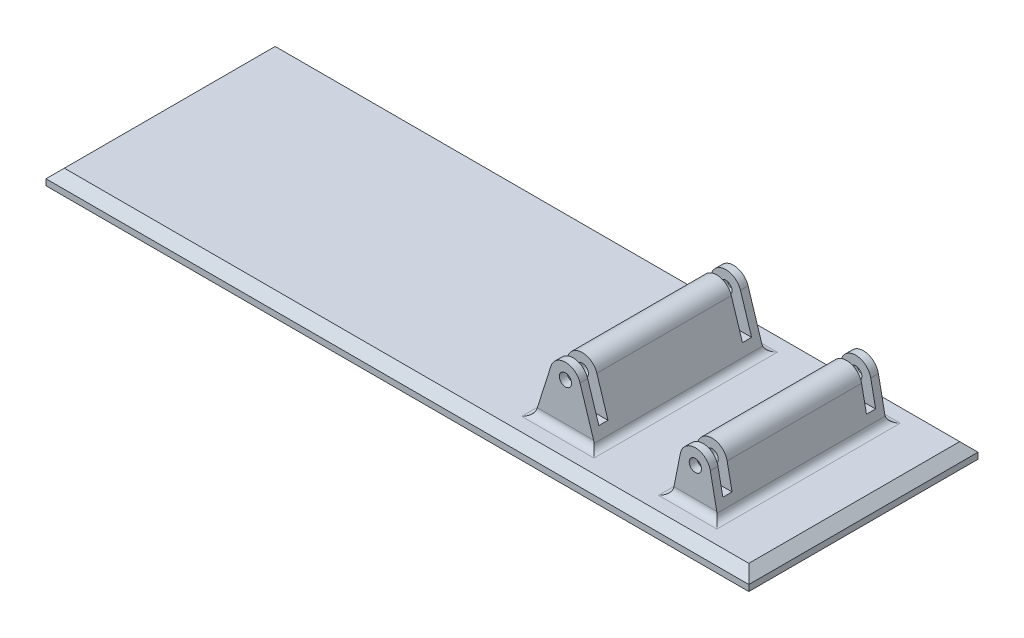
ISO-10303-21;
HEADER;
FILE_DESCRIPTION(('STEP AP214'),'2;1');
FILE_NAME('part.step','',(''),(''),'','','');
FILE_SCHEMA(('AUTOMOTIVE_DESIGN { 1 0 10303 214 1 1 1 1 }'));
ENDSEC;
DATA;
#1=APPLICATION_CONTEXT('core data for automotive mechanical design processes');
#2=APPLICATION_PROTOCOL_DEFINITION('international standard','automotive_design',2000,#1);
#3=PRODUCT_CONTEXT('',#1,'mechanical');
#4=PRODUCT('Part','Part','',(#3));
#5=PRODUCT_RELATED_PRODUCT_CATEGORY('part','',(#4));
#6=PRODUCT_DEFINITION_FORMATION('','',#4);
#7=PRODUCT_DEFINITION_CONTEXT('part definition',#1,'design');
#8=PRODUCT_DEFINITION('design','',#6,#7);
#9=PRODUCT_DEFINITION_SHAPE('','',#8);
#10=(LENGTH_UNIT() NAMED_UNIT(*) SI_UNIT(.MILLI.,.METRE.));
#11=(NAMED_UNIT(*) PLANE_ANGLE_UNIT() SI_UNIT($,.RADIAN.));
#12=(NAMED_UNIT(*) SI_UNIT($,.STERADIAN.) SOLID_ANGLE_UNIT());
#13=UNCERTAINTY_MEASURE_WITH_UNIT(LENGTH_MEASURE(1.E-05),#10,'distance_accuracy_value','');
#14=(GEOMETRIC_REPRESENTATION_CONTEXT(3) GLOBAL_UNCERTAINTY_ASSIGNED_CONTEXT((#13)) GLOBAL_UNIT_ASSIGNED_CONTEXT((#10,
#11,#12)) REPRESENTATION_CONTEXT('',''));
#15=CARTESIAN_POINT('',(0.,0.,0.));
#16=DIRECTION('',(0.,0.,1.));
#17=DIRECTION('',(1.,0.,0.));
#18=AXIS2_PLACEMENT_3D('',#15,#16,#17);
#19=CARTESIAN_POINT('',(114.3,38.1,-69.85));
#20=DIRECTION('',(0.,0.,1.));
#21=DIRECTION('',(1.,0.,0.));
#22=AXIS2_PLACEMENT_3D('',#19,#20,#21);
#23=CYLINDRICAL_SURFACE('',#22,12.7);
#24=CARTESIAN_POINT('',(114.3,38.1,-55.88));
#25=DIRECTION('',(0.,0.,-1.));
#26=DIRECTION('',(0.,1.,0.));
#27=AXIS2_PLACEMENT_3D('',#24,#25,#26);
#28=CIRCLE('',#27,12.7);
#29=CARTESIAN_POINT('',(126.40632857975,41.9375523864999,-55.88));
#30=VERTEX_POINT('',#29);
#31=CARTESIAN_POINT('',(102.19367142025,41.9375523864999,-55.88));
#32=VERTEX_POINT('',#31);
#33=EDGE_CURVE('E328',#30,#32,#28,.F.);
#34=ORIENTED_EDGE('',*,*,#33,.T.);
#35=DIRECTION('',(0.,0.,1.));
#36=VECTOR('',#35,1.);
#37=CARTESIAN_POINT('',(102.19367142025,41.9375523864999,-69.85));
#38=LINE('',#37,#36);
#39=CARTESIAN_POINT('',(102.19367142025,41.9375523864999,55.88));
#40=VERTEX_POINT('',#39);
#41=EDGE_CURVE('E424',#32,#40,#38,.T.);
#42=ORIENTED_EDGE('',*,*,#41,.T.);
#43=CARTESIAN_POINT('',(114.3,38.1,55.88));
#44=DIRECTION('',(0.,0.,-1.));
#45=DIRECTION('',(0.,1.,0.));
#46=AXIS2_PLACEMENT_3D('',#43,#44,#45);
#47=CIRCLE('',#46,12.7);
#48=CARTESIAN_POINT('',(126.40632857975,41.9375523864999,55.88));
#49=VERTEX_POINT('',#48);
#50=EDGE_CURVE('E357',#49,#40,#47,.F.);
#51=ORIENTED_EDGE('',*,*,#50,.F.);
#52=DIRECTION('',(0.,0.,1.));
#53=VECTOR('',#52,1.);
#54=CARTESIAN_POINT('',(126.40632857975,41.9375523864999,-69.85));
#55=LINE('',#54,#53);
#56=EDGE_CURVE('E429',#30,#49,#55,.T.);
#57=ORIENTED_EDGE('',*,*,#56,.F.);
#58=EDGE_LOOP('',(#34,#42,#51,#57));
#59=FACE_BOUND('',#58,.T.);
#60=ADVANCED_FACE('F37',(#59),#23,.T.);
#61=CARTESIAN_POINT('',(114.3,38.1,-63.5));
#62=DIRECTION('',(0.,0.,1.));
#63=DIRECTION('',(1.,0.,0.));
#64=AXIS2_PLACEMENT_3D('',#61,#62,#63);
#65=CIRCLE('',#64,12.7);
#66=CARTESIAN_POINT('',(102.19367142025,41.9375523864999,-63.5));
#67=VERTEX_POINT('',#66);
#68=CARTESIAN_POINT('',(126.40632857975,41.9375523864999,-63.5));
#69=VERTEX_POINT('',#68);
#70=EDGE_CURVE('E54',#67,#69,#65,.F.);
#71=ORIENTED_EDGE('',*,*,#70,.T.);
#72=CARTESIAN_POINT('',(126.40632857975,41.9375523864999,-69.85));
#73=VERTEX_POINT('',#72);
#74=EDGE_CURVE('E426',#73,#69,#55,.T.);
#75=ORIENTED_EDGE('',*,*,#74,.F.);
#76=CARTESIAN_POINT('',(114.3,38.1,-69.85));
#77=DIRECTION('',(0.,0.,1.));
#78=DIRECTION('',(1.,0.,0.));
#79=AXIS2_PLACEMENT_3D('',#76,#77,#78);
#80=CIRCLE('',#79,12.7);
#81=CARTESIAN_POINT('',(102.19367142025,41.9375523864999,-69.85));
#82=VERTEX_POINT('',#81);
#83=EDGE_CURVE('E413',#73,#82,#80,.T.);
#84=ORIENTED_EDGE('',*,*,#83,.T.);
#85=EDGE_CURVE('E420',#82,#67,#38,.T.);
#86=ORIENTED_EDGE('',*,*,#85,.T.);
#87=EDGE_LOOP('',(#71,#75,#84,#86));
#88=FACE_BOUND('',#87,.T.);
#89=ADVANCED_FACE('F647',(#88),#23,.T.);
#90=CARTESIAN_POINT('',(222.25,30.48,-69.85));
#91=DIRECTION('',(0.,0.,1.));
#92=DIRECTION('',(1.,0.,0.));
#93=AXIS2_PLACEMENT_3D('',#90,#91,#92);
#94=CYLINDRICAL_SURFACE('',#93,12.7);
#95=DIRECTION('',(0.,0.,1.));
#96=VECTOR('',#95,1.);
#97=CARTESIAN_POINT('',(234.703193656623,32.9715793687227,-69.85));
#98=LINE('',#97,#96);
#99=CARTESIAN_POINT('',(234.703193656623,32.9715793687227,-55.88));
#100=VERTEX_POINT('',#99);
#101=CARTESIAN_POINT('',(234.703193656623,32.9715793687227,55.88));
#102=VERTEX_POINT('',#101);
#103=EDGE_CURVE('E401',#100,#102,#98,.T.);
#104=ORIENTED_EDGE('',*,*,#103,.F.);
#105=CARTESIAN_POINT('',(222.25,30.48,-55.88));
#106=DIRECTION('',(0.,0.,-1.));
#107=DIRECTION('',(0.,1.,0.));
#108=AXIS2_PLACEMENT_3D('',#105,#106,#107);
#109=CIRCLE('',#108,12.7);
#110=CARTESIAN_POINT('',(209.796806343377,32.9715793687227,-55.88));
#111=VERTEX_POINT('',#110);
#112=EDGE_CURVE('E320',#100,#111,#109,.F.);
#113=ORIENTED_EDGE('',*,*,#112,.T.);
#114=DIRECTION('',(0.,0.,1.));
#115=VECTOR('',#114,1.);
#116=CARTESIAN_POINT('',(209.796806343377,32.9715793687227,-69.85));
#117=LINE('',#116,#115);
#118=CARTESIAN_POINT('',(209.796806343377,32.9715793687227,55.88));
#119=VERTEX_POINT('',#118);
#120=EDGE_CURVE('E398',#111,#119,#117,.T.);
#121=ORIENTED_EDGE('',*,*,#120,.T.);
#122=CARTESIAN_POINT('',(222.25,30.48,55.88));
#123=DIRECTION('',(0.,0.,-1.));
#124=DIRECTION('',(0.,1.,0.));
#125=AXIS2_PLACEMENT_3D('',#122,#123,#124);
#126=CIRCLE('',#125,12.7);
#127=EDGE_CURVE('E557',#102,#119,#126,.F.);
#128=ORIENTED_EDGE('',*,*,#127,.F.);
#129=EDGE_LOOP('',(#104,#113,#121,#128));
#130=FACE_BOUND('',#129,.T.);
#131=ADVANCED_FACE('F644',(#130),#94,.T.);
#132=CARTESIAN_POINT('',(209.796806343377,32.9715793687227,-69.85));
#133=VERTEX_POINT('',#132);
#134=CARTESIAN_POINT('',(209.796806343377,32.9715793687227,-63.5));
#135=VERTEX_POINT('',#134);
#136=EDGE_CURVE('E394',#133,#135,#117,.T.);
#137=ORIENTED_EDGE('',*,*,#136,.T.);
#138=CARTESIAN_POINT('',(222.25,30.48,-63.5));
#139=DIRECTION('',(0.,0.,1.));
#140=DIRECTION('',(1.,0.,0.));
#141=AXIS2_PLACEMENT_3D('',#138,#139,#140);
#142=CIRCLE('',#141,12.7);
#143=CARTESIAN_POINT('',(234.703193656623,32.9715793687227,-63.5));
#144=VERTEX_POINT('',#143);
#145=EDGE_CURVE('E62',#135,#144,#142,.F.);
#146=ORIENTED_EDGE('',*,*,#145,.T.);
#147=CARTESIAN_POINT('',(234.703193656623,32.9715793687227,-69.85));
#148=VERTEX_POINT('',#147);
#149=EDGE_CURVE('E307',#148,#144,#98,.T.);
#150=ORIENTED_EDGE('',*,*,#149,.F.);
#151=CARTESIAN_POINT('',(222.25,30.48,-69.85));
#152=DIRECTION('',(0.,0.,1.));
#153=DIRECTION('',(1.,0.,0.));
#154=AXIS2_PLACEMENT_3D('',#151,#152,#153);
#155=CIRCLE('',#154,12.7);
#156=EDGE_CURVE('E387',#148,#133,#155,.T.);
#157=ORIENTED_EDGE('',*,*,#156,.T.);
#158=EDGE_LOOP('',(#137,#146,#150,#157));
#159=FACE_BOUND('',#158,.T.);
#160=ADVANCED_FACE('F646',(#159),#94,.T.);
#161=CARTESIAN_POINT('',(171.433779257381,-100.110570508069,-69.85));
#162=DIRECTION('',(-0.953254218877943,-0.302169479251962,0.));
#163=DIRECTION('',(0.302169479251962,-0.953254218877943,0.));
#164=AXIS2_PLACEMENT_3D('',#161,#162,#163);
#165=PLANE('',#164);
#166=DIRECTION('',(0.302169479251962,-0.953254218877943,0.));
#167=VECTOR('',#166,1.);
#168=CARTESIAN_POINT('',(171.433779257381,-100.110570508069,-55.88));
#169=LINE('',#168,#167);
#170=CARTESIAN_POINT('',(135.674261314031,12.7,-55.88));
#171=VERTEX_POINT('',#170);
#172=EDGE_CURVE('E330',#30,#171,#169,.T.);
#173=ORIENTED_EDGE('',*,*,#172,.F.);
#174=ORIENTED_EDGE('',*,*,#56,.T.);
#175=DIRECTION('',(0.302169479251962,-0.953254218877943,0.));
#176=VECTOR('',#175,1.);
#177=CARTESIAN_POINT('',(171.433779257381,-100.110570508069,55.88));
#178=LINE('',#177,#176);
#179=CARTESIAN_POINT('',(135.674261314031,12.7,55.88));
#180=VERTEX_POINT('',#179);
#181=EDGE_CURVE('E362',#49,#180,#178,.T.);
#182=ORIENTED_EDGE('',*,*,#181,.T.);
#183=DIRECTION('',(0.,0.,1.));
#184=VECTOR('',#183,1.);
#185=CARTESIAN_POINT('',(135.674261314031,12.7,-69.85));
#186=LINE('',#185,#184);
#187=CARTESIAN_POINT('',(135.674261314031,12.7,63.5));
#188=VERTEX_POINT('',#187);
#189=EDGE_CURVE('E370',#180,#188,#186,.T.);
#190=ORIENTED_EDGE('',*,*,#189,.T.);
#191=DIRECTION('',(-0.302169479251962,0.953254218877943,0.));
#192=VECTOR('',#191,1.);
#193=CARTESIAN_POINT('',(171.433779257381,-100.110570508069,63.5));
#194=LINE('',#193,#192);
#195=CARTESIAN_POINT('',(126.40632857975,41.9375523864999,63.5));
#196=VERTEX_POINT('',#195);
#197=EDGE_CURVE('E349',#188,#196,#194,.T.);
#198=ORIENTED_EDGE('',*,*,#197,.T.);
#199=CARTESIAN_POINT('',(126.40632857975,41.9375523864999,69.85));
#200=VERTEX_POINT('',#199);
#201=EDGE_CURVE('E419',#196,#200,#55,.T.);
#202=ORIENTED_EDGE('',*,*,#201,.T.);
#203=DIRECTION('',(0.302169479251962,-0.953254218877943,0.));
#204=VECTOR('',#203,1.);
#205=CARTESIAN_POINT('',(171.433779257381,-100.110570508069,69.85));
#206=LINE('',#205,#204);
#207=CARTESIAN_POINT('',(137.687130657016,6.34999999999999,69.85));
#208=VERTEX_POINT('',#207);
#209=EDGE_CURVE('E397',#200,#208,#206,.T.);
#210=ORIENTED_EDGE('',*,*,#209,.T.);
#211=CARTESIAN_POINT('',(137.687130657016,6.34999999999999,76.2));
#212=DIRECTION('',(-0.953254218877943,-0.302169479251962,0.));
#213=DIRECTION('',(-0.302169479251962,0.953254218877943,0.));
#214=AXIS2_PLACEMENT_3D('',#211,#212,#213);
#215=ELLIPSE('',#214,6.66139197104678,6.35);
#216=CARTESIAN_POINT('',(138.295358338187,4.43122380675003,70.146835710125));
#217=VERTEX_POINT('',#216);
#218=EDGE_CURVE('E530',#208,#217,#215,.T.);
#219=ORIENTED_EDGE('',*,*,#218,.T.);
#220=DIRECTION('',(0.,0.,1.));
#221=VECTOR('',#220,1.);
#222=CARTESIAN_POINT('',(138.295358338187,4.43122380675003,-69.85));
#223=LINE('',#222,#221);
#224=CARTESIAN_POINT('',(138.295358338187,4.43122380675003,-70.1468357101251));
#225=VERTEX_POINT('',#224);
#226=EDGE_CURVE('E509',#217,#225,#223,.F.);
#227=ORIENTED_EDGE('',*,*,#226,.T.);
#228=CARTESIAN_POINT('',(137.687130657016,6.35,-76.2));
#229=DIRECTION('',(-0.953254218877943,-0.302169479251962,0.));
#230=DIRECTION('',(0.302169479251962,-0.953254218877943,0.));
#231=AXIS2_PLACEMENT_3D('',#228,#229,#230);
#232=ELLIPSE('',#231,6.66139197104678,6.35);
#233=CARTESIAN_POINT('',(137.687130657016,6.34999999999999,-69.85));
#234=VERTEX_POINT('',#233);
#235=EDGE_CURVE('E525',#225,#234,#232,.T.);
#236=ORIENTED_EDGE('',*,*,#235,.T.);
#237=DIRECTION('',(0.302169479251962,-0.953254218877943,0.));
#238=VECTOR('',#237,1.);
#239=CARTESIAN_POINT('',(171.433779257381,-100.110570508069,-69.85));
#240=LINE('',#239,#238);
#241=EDGE_CURVE('E410',#73,#234,#240,.T.);
#242=ORIENTED_EDGE('',*,*,#241,.F.);
#243=ORIENTED_EDGE('',*,*,#74,.T.);
#244=DIRECTION('',(-0.302169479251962,0.953254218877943,0.));
#245=VECTOR('',#244,1.);
#246=CARTESIAN_POINT('',(171.433779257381,-100.110570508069,-63.5));
#247=LINE('',#246,#245);
#248=CARTESIAN_POINT('',(135.674261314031,12.7,-63.5));
#249=VERTEX_POINT('',#248);
#250=EDGE_CURVE('E296',#249,#69,#247,.T.);
#251=ORIENTED_EDGE('',*,*,#250,.F.);
#252=DIRECTION('',(0.,0.,1.));
#253=VECTOR('',#252,1.);
#254=CARTESIAN_POINT('',(135.674261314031,12.7,-69.85));
#255=LINE('',#254,#253);
#256=EDGE_CURVE('E317',#249,#171,#255,.T.);
#257=ORIENTED_EDGE('',*,*,#256,.T.);
#258=EDGE_LOOP('',(#173,#174,#182,#190,#198,#202,#210,#219,#227,#236,#242,#243,#251,#257));
#259=FACE_BOUND('',#258,.T.);
#260=ADVANCED_FACE('F653',(#259),#165,.F.);
#261=CARTESIAN_POINT('',(66.4429503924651,-70.8452664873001,-69.85));
#262=DIRECTION('',(-0.953254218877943,0.302169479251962,0.));
#263=DIRECTION('',(-0.302169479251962,-0.953254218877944,0.));
#264=AXIS2_PLACEMENT_3D('',#261,#262,#263);
#265=PLANE('',#264);
#266=ORIENTED_EDGE('',*,*,#41,.F.);
#267=DIRECTION('',(-0.302169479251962,-0.953254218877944,0.));
#268=VECTOR('',#267,1.);
#269=CARTESIAN_POINT('',(66.4429503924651,-70.8452664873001,-55.88));
#270=LINE('',#269,#268);
#271=CARTESIAN_POINT('',(92.9257386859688,12.7,-55.88));
#272=VERTEX_POINT('',#271);
#273=EDGE_CURVE('E325',#32,#272,#270,.T.);
#274=ORIENTED_EDGE('',*,*,#273,.T.);
#275=DIRECTION('',(0.,0.,1.));
#276=VECTOR('',#275,1.);
#277=CARTESIAN_POINT('',(92.9257386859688,12.7,-69.85));
#278=LINE('',#277,#276);
#279=CARTESIAN_POINT('',(92.9257386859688,12.7,-63.5));
#280=VERTEX_POINT('',#279);
#281=EDGE_CURVE('E295',#280,#272,#278,.T.);
#282=ORIENTED_EDGE('',*,*,#281,.F.);
#283=DIRECTION('',(0.302169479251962,0.953254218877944,0.));
#284=VECTOR('',#283,1.);
#285=CARTESIAN_POINT('',(66.4429503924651,-70.8452664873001,-63.5));
#286=LINE('',#285,#284);
#287=EDGE_CURVE('E308',#280,#67,#286,.T.);
#288=ORIENTED_EDGE('',*,*,#287,.T.);
#289=ORIENTED_EDGE('',*,*,#85,.F.);
#290=DIRECTION('',(-0.302169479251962,-0.953254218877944,0.));
#291=VECTOR('',#290,1.);
#292=CARTESIAN_POINT('',(66.4429503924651,-70.8452664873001,-69.85));
#293=LINE('',#292,#291);
#294=CARTESIAN_POINT('',(90.9128693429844,6.34999999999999,-69.85));
#295=VERTEX_POINT('',#294);
#296=EDGE_CURVE('E416',#82,#295,#293,.T.);
#297=ORIENTED_EDGE('',*,*,#296,.T.);
#298=CARTESIAN_POINT('',(90.9128693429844,6.35,-76.2));
#299=DIRECTION('',(-0.953254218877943,0.302169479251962,0.));
#300=DIRECTION('',(0.302169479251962,0.953254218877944,0.));
#301=AXIS2_PLACEMENT_3D('',#298,#299,#300);
#302=ELLIPSE('',#301,6.66139197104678,6.35);
#303=CARTESIAN_POINT('',(90.3046416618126,4.43122380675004,-70.146835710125));
#304=VERTEX_POINT('',#303);
#305=EDGE_CURVE('E527',#295,#304,#302,.F.);
#306=ORIENTED_EDGE('',*,*,#305,.T.);
#307=DIRECTION('',(0.,0.,1.));
#308=VECTOR('',#307,1.);
#309=CARTESIAN_POINT('',(90.3046416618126,4.43122380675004,69.8499999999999));
#310=LINE('',#309,#308);
#311=CARTESIAN_POINT('',(90.3046416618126,4.43122380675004,70.146835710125));
#312=VERTEX_POINT('',#311);
#313=EDGE_CURVE('E513',#304,#312,#310,.T.);
#314=ORIENTED_EDGE('',*,*,#313,.T.);
#315=CARTESIAN_POINT('',(90.9128693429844,6.34999999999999,76.2));
#316=DIRECTION('',(-0.953254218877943,0.302169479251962,0.));
#317=DIRECTION('',(-0.302169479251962,-0.953254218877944,0.));
#318=AXIS2_PLACEMENT_3D('',#315,#316,#317);
#319=ELLIPSE('',#318,6.66139197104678,6.35);
#320=CARTESIAN_POINT('',(90.9128693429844,6.34999999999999,69.85));
#321=VERTEX_POINT('',#320);
#322=EDGE_CURVE('E533',#312,#321,#319,.F.);
#323=ORIENTED_EDGE('',*,*,#322,.T.);
#324=DIRECTION('',(-0.302169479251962,-0.953254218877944,0.));
#325=VECTOR('',#324,1.);
#326=CARTESIAN_POINT('',(66.4429503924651,-70.8452664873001,69.85));
#327=LINE('',#326,#325);
#328=CARTESIAN_POINT('',(102.19367142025,41.9375523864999,69.85));
#329=VERTEX_POINT('',#328);
#330=EDGE_CURVE('E407',#329,#321,#327,.T.);
#331=ORIENTED_EDGE('',*,*,#330,.F.);
#332=CARTESIAN_POINT('',(102.19367142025,41.9375523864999,63.5));
#333=VERTEX_POINT('',#332);
#334=EDGE_CURVE('E425',#333,#329,#38,.T.);
#335=ORIENTED_EDGE('',*,*,#334,.F.);
#336=DIRECTION('',(0.302169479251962,0.953254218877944,0.));
#337=VECTOR('',#336,1.);
#338=CARTESIAN_POINT('',(66.4429503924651,-70.8452664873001,63.5));
#339=LINE('',#338,#337);
#340=CARTESIAN_POINT('',(92.9257386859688,12.7,63.5));
#341=VERTEX_POINT('',#340);
#342=EDGE_CURVE('E347',#341,#333,#339,.T.);
#343=ORIENTED_EDGE('',*,*,#342,.F.);
#344=DIRECTION('',(0.,0.,1.));
#345=VECTOR('',#344,1.);
#346=CARTESIAN_POINT('',(92.9257386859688,12.7,-69.85));
#347=LINE('',#346,#345);
#348=CARTESIAN_POINT('',(92.9257386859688,12.7,55.88));
#349=VERTEX_POINT('',#348);
#350=EDGE_CURVE('E368',#349,#341,#347,.T.);
#351=ORIENTED_EDGE('',*,*,#350,.F.);
#352=DIRECTION('',(-0.302169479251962,-0.953254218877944,0.));
#353=VECTOR('',#352,1.);
#354=CARTESIAN_POINT('',(66.4429503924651,-70.8452664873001,55.88));
#355=LINE('',#354,#353);
#356=EDGE_CURVE('E360',#40,#349,#355,.T.);
#357=ORIENTED_EDGE('',*,*,#356,.F.);
#358=EDGE_LOOP('',(#266,#274,#282,#288,#289,#297,#306,#314,#323,#331,#335,#343,#351,#357));
#359=FACE_BOUND('',#358,.T.);
#360=ADVANCED_FACE('F703',(#359),#265,.T.);
#361=CARTESIAN_POINT('',(258.012081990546,-83.5288636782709,-69.85));
#362=DIRECTION('',(-0.980566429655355,-0.196187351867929,0.));
#363=DIRECTION('',(0.196187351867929,-0.980566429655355,0.));
#364=AXIS2_PLACEMENT_3D('',#361,#362,#363);
#365=PLANE('',#364);
#366=DIRECTION('',(0.196187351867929,-0.980566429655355,0.));
#367=VECTOR('',#366,1.);
#368=CARTESIAN_POINT('',(258.012081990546,-83.5288636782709,-55.88));
#369=LINE('',#368,#367);
#370=CARTESIAN_POINT('',(238.759040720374,12.7,-55.88));
#371=VERTEX_POINT('',#370);
#372=EDGE_CURVE('E323',#100,#371,#369,.T.);
#373=ORIENTED_EDGE('',*,*,#372,.F.);
#374=ORIENTED_EDGE('',*,*,#103,.T.);
#375=DIRECTION('',(0.196187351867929,-0.980566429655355,0.));
#376=VECTOR('',#375,1.);
#377=CARTESIAN_POINT('',(258.012081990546,-83.5288636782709,55.88));
#378=LINE('',#377,#376);
#379=CARTESIAN_POINT('',(238.759040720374,12.7,55.88));
#380=VERTEX_POINT('',#379);
#381=EDGE_CURVE('E354',#102,#380,#378,.T.);
#382=ORIENTED_EDGE('',*,*,#381,.T.);
#383=DIRECTION('',(0.,0.,1.));
#384=VECTOR('',#383,1.);
#385=CARTESIAN_POINT('',(238.759040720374,12.7,-69.85));
#386=LINE('',#385,#384);
#387=CARTESIAN_POINT('',(238.759040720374,12.7,63.5));
#388=VERTEX_POINT('',#387);
#389=EDGE_CURVE('E365',#380,#388,#386,.T.);
#390=ORIENTED_EDGE('',*,*,#389,.T.);
#391=DIRECTION('',(-0.196187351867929,0.980566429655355,0.));
#392=VECTOR('',#391,1.);
#393=CARTESIAN_POINT('',(258.012081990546,-83.5288636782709,63.5));
#394=LINE('',#393,#392);
#395=CARTESIAN_POINT('',(234.703193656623,32.9715793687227,63.5));
#396=VERTEX_POINT('',#395);
#397=EDGE_CURVE('E342',#388,#396,#394,.T.);
#398=ORIENTED_EDGE('',*,*,#397,.T.);
#399=CARTESIAN_POINT('',(234.703193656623,32.9715793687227,69.85));
#400=VERTEX_POINT('',#399);
#401=EDGE_CURVE('E393',#396,#400,#98,.T.);
#402=ORIENTED_EDGE('',*,*,#401,.T.);
#403=DIRECTION('',(0.196187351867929,-0.980566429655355,0.));
#404=VECTOR('',#403,1.);
#405=CARTESIAN_POINT('',(258.012081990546,-83.5288636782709,69.85));
#406=LINE('',#405,#404);
#407=CARTESIAN_POINT('',(240.029520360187,6.35000000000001,69.85));
#408=VERTEX_POINT('',#407);
#409=EDGE_CURVE('E374',#400,#408,#406,.T.);
#410=ORIENTED_EDGE('',*,*,#409,.T.);
#411=CARTESIAN_POINT('',(240.029520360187,6.34999999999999,76.2));
#412=DIRECTION('',(-0.980566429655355,-0.196187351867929,0.));
#413=DIRECTION('',(-0.196187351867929,0.980566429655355,0.));
#414=AXIS2_PLACEMENT_3D('',#411,#412,#413);
#415=ELLIPSE('',#414,6.47584886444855,6.35);
#416=CARTESIAN_POINT('',(240.278772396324,5.10421031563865,69.9734031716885));
#417=VERTEX_POINT('',#416);
#418=EDGE_CURVE('E520',#408,#417,#415,.T.);
#419=ORIENTED_EDGE('',*,*,#418,.T.);
#420=DIRECTION('',(0.,0.,1.));
#421=VECTOR('',#420,1.);
#422=CARTESIAN_POINT('',(240.278772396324,5.10421031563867,-69.85));
#423=LINE('',#422,#421);
#424=CARTESIAN_POINT('',(240.278772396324,5.10421031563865,-69.9734031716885));
#425=VERTEX_POINT('',#424);
#426=EDGE_CURVE('E500',#417,#425,#423,.F.);
#427=ORIENTED_EDGE('',*,*,#426,.T.);
#428=CARTESIAN_POINT('',(240.029520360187,6.35,-76.2));
#429=DIRECTION('',(-0.980566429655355,-0.196187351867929,0.));
#430=DIRECTION('',(0.196187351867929,-0.980566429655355,0.));
#431=AXIS2_PLACEMENT_3D('',#428,#429,#430);
#432=ELLIPSE('',#431,6.47584886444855,6.35);
#433=CARTESIAN_POINT('',(240.029520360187,6.35000000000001,-69.85));
#434=VERTEX_POINT('',#433);
#435=EDGE_CURVE('E515',#425,#434,#432,.T.);
#436=ORIENTED_EDGE('',*,*,#435,.T.);
#437=DIRECTION('',(0.196187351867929,-0.980566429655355,0.));
#438=VECTOR('',#437,1.);
#439=CARTESIAN_POINT('',(258.012081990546,-83.5288636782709,-69.85));
#440=LINE('',#439,#438);
#441=EDGE_CURVE('E384',#148,#434,#440,.T.);
#442=ORIENTED_EDGE('',*,*,#441,.F.);
#443=ORIENTED_EDGE('',*,*,#149,.T.);
#444=DIRECTION('',(-0.196187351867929,0.980566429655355,0.));
#445=VECTOR('',#444,1.);
#446=CARTESIAN_POINT('',(258.012081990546,-83.5288636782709,-63.5));
#447=LINE('',#446,#445);
#448=CARTESIAN_POINT('',(238.759040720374,12.7,-63.5));
#449=VERTEX_POINT('',#448);
#450=EDGE_CURVE('E299',#449,#144,#447,.T.);
#451=ORIENTED_EDGE('',*,*,#450,.F.);
#452=DIRECTION('',(0.,0.,1.));
#453=VECTOR('',#452,1.);
#454=CARTESIAN_POINT('',(238.759040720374,12.7,-69.85));
#455=LINE('',#454,#453);
#456=EDGE_CURVE('E285',#449,#371,#455,.T.);
#457=ORIENTED_EDGE('',*,*,#456,.T.);
#458=EDGE_LOOP('',(#373,#374,#382,#390,#398,#402,#410,#419,#427,#436,#442,#443,#451,#457));
#459=FACE_BOUND('',#458,.T.);
#460=ADVANCED_FACE('F305',(#459),#365,.F.);
#461=CARTESIAN_POINT('',(182.088570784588,-105.517295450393,-69.85));
#462=DIRECTION('',(-0.980566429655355,0.196187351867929,0.));
#463=DIRECTION('',(-0.196187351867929,-0.980566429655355,0.));
#464=AXIS2_PLACEMENT_3D('',#461,#462,#463);
#465=PLANE('',#464);
#466=ORIENTED_EDGE('',*,*,#120,.F.);
#467=DIRECTION('',(-0.196187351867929,-0.980566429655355,0.));
#468=VECTOR('',#467,1.);
#469=CARTESIAN_POINT('',(182.088570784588,-105.517295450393,-55.88));
#470=LINE('',#469,#468);
#471=CARTESIAN_POINT('',(205.740959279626,12.7,-55.88));
#472=VERTEX_POINT('',#471);
#473=EDGE_CURVE('E11',#111,#472,#470,.T.);
#474=ORIENTED_EDGE('',*,*,#473,.T.);
#475=DIRECTION('',(0.,0.,1.));
#476=VECTOR('',#475,1.);
#477=CARTESIAN_POINT('',(205.740959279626,12.7,-69.85));
#478=LINE('',#477,#476);
#479=CARTESIAN_POINT('',(205.740959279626,12.7,-63.5));
#480=VERTEX_POINT('',#479);
#481=EDGE_CURVE('E46',#480,#472,#478,.T.);
#482=ORIENTED_EDGE('',*,*,#481,.F.);
#483=DIRECTION('',(0.196187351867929,0.980566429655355,0.));
#484=VECTOR('',#483,1.);
#485=CARTESIAN_POINT('',(182.088570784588,-105.517295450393,-63.5));
#486=LINE('',#485,#484);
#487=EDGE_CURVE('E300',#480,#135,#486,.T.);
#488=ORIENTED_EDGE('',*,*,#487,.T.);
#489=ORIENTED_EDGE('',*,*,#136,.F.);
#490=DIRECTION('',(-0.196187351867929,-0.980566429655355,0.));
#491=VECTOR('',#490,1.);
#492=CARTESIAN_POINT('',(182.088570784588,-105.517295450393,-69.85));
#493=LINE('',#492,#491);
#494=CARTESIAN_POINT('',(204.470479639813,6.35000000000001,-69.85));
#495=VERTEX_POINT('',#494);
#496=EDGE_CURVE('E390',#133,#495,#493,.T.);
#497=ORIENTED_EDGE('',*,*,#496,.T.);
#498=CARTESIAN_POINT('',(204.470479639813,6.35,-76.2));
#499=DIRECTION('',(-0.980566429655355,0.196187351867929,0.));
#500=DIRECTION('',(0.196187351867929,0.980566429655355,0.));
#501=AXIS2_PLACEMENT_3D('',#498,#499,#500);
#502=ELLIPSE('',#501,6.47584886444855,6.35);
#503=CARTESIAN_POINT('',(204.221227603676,5.10421031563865,-69.9734031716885));
#504=VERTEX_POINT('',#503);
#505=EDGE_CURVE('E517',#495,#504,#502,.F.);
#506=ORIENTED_EDGE('',*,*,#505,.T.);
#507=DIRECTION('',(0.,0.,1.));
#508=VECTOR('',#507,1.);
#509=CARTESIAN_POINT('',(204.221227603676,5.10421031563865,69.85));
#510=LINE('',#509,#508);
#511=CARTESIAN_POINT('',(204.221227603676,5.10421031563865,69.9734031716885));
#512=VERTEX_POINT('',#511);
#513=EDGE_CURVE('E504',#504,#512,#510,.T.);
#514=ORIENTED_EDGE('',*,*,#513,.T.);
#515=CARTESIAN_POINT('',(204.470479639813,6.34999999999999,76.2));
#516=DIRECTION('',(-0.980566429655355,0.196187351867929,0.));
#517=DIRECTION('',(-0.196187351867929,-0.980566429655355,0.));
#518=AXIS2_PLACEMENT_3D('',#515,#516,#517);
#519=ELLIPSE('',#518,6.47584886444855,6.35);
#520=CARTESIAN_POINT('',(204.470479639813,6.35000000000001,69.85));
#521=VERTEX_POINT('',#520);
#522=EDGE_CURVE('E523',#512,#521,#519,.F.);
#523=ORIENTED_EDGE('',*,*,#522,.T.);
#524=DIRECTION('',(-0.196187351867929,-0.980566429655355,0.));
#525=VECTOR('',#524,1.);
#526=CARTESIAN_POINT('',(182.088570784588,-105.517295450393,69.85));
#527=LINE('',#526,#525);
#528=CARTESIAN_POINT('',(209.796806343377,32.9715793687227,69.85));
#529=VERTEX_POINT('',#528);
#530=EDGE_CURVE('E381',#529,#521,#527,.T.);
#531=ORIENTED_EDGE('',*,*,#530,.F.);
#532=CARTESIAN_POINT('',(209.796806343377,32.9715793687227,63.5));
#533=VERTEX_POINT('',#532);
#534=EDGE_CURVE('E399',#533,#529,#117,.T.);
#535=ORIENTED_EDGE('',*,*,#534,.F.);
#536=DIRECTION('',(0.196187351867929,0.980566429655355,0.));
#537=VECTOR('',#536,1.);
#538=CARTESIAN_POINT('',(182.088570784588,-105.517295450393,63.5));
#539=LINE('',#538,#537);
#540=CARTESIAN_POINT('',(205.740959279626,12.7,63.5));
#541=VERTEX_POINT('',#540);
#542=EDGE_CURVE('E340',#541,#533,#539,.T.);
#543=ORIENTED_EDGE('',*,*,#542,.F.);
#544=DIRECTION('',(0.,0.,1.));
#545=VECTOR('',#544,1.);
#546=CARTESIAN_POINT('',(205.740959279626,12.7,-69.85));
#547=LINE('',#546,#545);
#548=CARTESIAN_POINT('',(205.740959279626,12.7,55.88));
#549=VERTEX_POINT('',#548);
#550=EDGE_CURVE('E560',#549,#541,#547,.T.);
#551=ORIENTED_EDGE('',*,*,#550,.F.);
#552=DIRECTION('',(-0.196187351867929,-0.980566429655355,0.));
#553=VECTOR('',#552,1.);
#554=CARTESIAN_POINT('',(182.088570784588,-105.517295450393,55.88));
#555=LINE('',#554,#553);
#556=EDGE_CURVE('E352',#119,#549,#555,.T.);
#557=ORIENTED_EDGE('',*,*,#556,.F.);
#558=EDGE_LOOP('',(#466,#474,#482,#488,#489,#497,#506,#514,#523,#531,#535,#543,#551,#557));
#559=FACE_BOUND('',#558,.T.);
#560=ADVANCED_FACE('F601',(#559),#465,.T.);
#561=CARTESIAN_POINT('',(-478.091035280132,0.,0.));
#562=DIRECTION('',(0.,1.,0.));
#563=DIRECTION('',(0.,0.,1.));
#564=AXIS2_PLACEMENT_3D('',#561,#562,#563);
#565=PLANE('',#564);
#566=DIRECTION('',(0.,0.,1.));
#567=VECTOR('',#566,1.);
#568=CARTESIAN_POINT('',(197.994630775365,0.,-69.85));
#569=LINE('',#568,#567);
#570=CARTESIAN_POINT('',(197.994630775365,0.,76.2));
#571=VERTEX_POINT('',#570);
#572=CARTESIAN_POINT('',(197.994630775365,0.,-76.2));
#573=VERTEX_POINT('',#572);
#574=EDGE_CURVE('E488',#571,#573,#569,.F.);
#575=ORIENTED_EDGE('',*,*,#574,.T.);
#576=DIRECTION('',(1.,0.,0.));
#577=VECTOR('',#576,1.);
#578=CARTESIAN_POINT('',(-478.091035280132,0.,-76.2));
#579=LINE('',#578,#577);
#580=CARTESIAN_POINT('',(246.505369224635,0.,-76.2));
#581=VERTEX_POINT('',#580);
#582=EDGE_CURVE('E494',#573,#581,#579,.T.);
#583=ORIENTED_EDGE('',*,*,#582,.T.);
#584=DIRECTION('',(0.,0.,1.));
#585=VECTOR('',#584,1.);
#586=CARTESIAN_POINT('',(246.505369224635,0.,0.));
#587=LINE('',#586,#585);
#588=CARTESIAN_POINT('',(246.505369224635,0.,76.2));
#589=VERTEX_POINT('',#588);
#590=EDGE_CURVE('E492',#581,#589,#587,.T.);
#591=ORIENTED_EDGE('',*,*,#590,.T.);
#592=DIRECTION('',(1.,0.,0.));
#593=VECTOR('',#592,1.);
#594=CARTESIAN_POINT('',(203.2,0.,76.2));
#595=LINE('',#594,#593);
#596=EDGE_CURVE('E490',#589,#571,#595,.F.);
#597=ORIENTED_EDGE('',*,*,#596,.T.);
#598=EDGE_LOOP('',(#575,#583,#591,#597));
#599=FACE_BOUND('',#598,.T.);
#600=DIRECTION('',(0.,0.,1.));
#601=VECTOR('',#600,1.);
#602=CARTESIAN_POINT('',(84.2514773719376,0.,-69.85));
#603=LINE('',#602,#601);
#604=CARTESIAN_POINT('',(84.2514773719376,0.,76.2));
#605=VERTEX_POINT('',#604);
#606=CARTESIAN_POINT('',(84.2514773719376,0.,-76.2));
#607=VERTEX_POINT('',#606);
#608=EDGE_CURVE('E471',#605,#607,#603,.F.);
#609=ORIENTED_EDGE('',*,*,#608,.T.);
#610=DIRECTION('',(1.,0.,0.));
#611=VECTOR('',#610,1.);
#612=CARTESIAN_POINT('',(-478.091035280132,0.,-76.2));
#613=LINE('',#612,#611);
#614=CARTESIAN_POINT('',(144.348522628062,0.,-76.2));
#615=VERTEX_POINT('',#614);
#616=EDGE_CURVE('E485',#607,#615,#613,.T.);
#617=ORIENTED_EDGE('',*,*,#616,.T.);
#618=DIRECTION('',(0.,0.,1.));
#619=VECTOR('',#618,1.);
#620=CARTESIAN_POINT('',(144.348522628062,0.,0.));
#621=LINE('',#620,#619);
#622=CARTESIAN_POINT('',(144.348522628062,0.,76.2));
#623=VERTEX_POINT('',#622);
#624=EDGE_CURVE('E483',#615,#623,#621,.T.);
#625=ORIENTED_EDGE('',*,*,#624,.T.);
#626=DIRECTION('',(1.,0.,0.));
#627=VECTOR('',#626,1.);
#628=CARTESIAN_POINT('',(88.9,0.,76.2));
#629=LINE('',#628,#627);
#630=EDGE_CURVE('E481',#623,#605,#629,.F.);
#631=ORIENTED_EDGE('',*,*,#630,.T.);
#632=EDGE_LOOP('',(#609,#617,#625,#631));
#633=FACE_BOUND('',#632,.T.);
#634=DIRECTION('',(0.,0.,-1.));
#635=VECTOR('',#634,1.);
#636=CARTESIAN_POINT('',(284.48,0.,0.));
#637=LINE('',#636,#635);
#638=CARTESIAN_POINT('',(284.48,0.,87.63));
#639=VERTEX_POINT('',#638);
#640=CARTESIAN_POINT('',(284.48,0.,-87.63));
#641=VERTEX_POINT('',#640);
#642=EDGE_CURVE('E460',#639,#641,#637,.T.);
#643=ORIENTED_EDGE('',*,*,#642,.T.);
#644=DIRECTION('',(-1.,0.,0.));
#645=VECTOR('',#644,1.);
#646=CARTESIAN_POINT('',(-292.1,0.,-87.63));
#647=LINE('',#646,#645);
#648=CARTESIAN_POINT('',(-284.48,0.,-87.63));
#649=VERTEX_POINT('',#648);
#650=EDGE_CURVE('E462',#641,#649,#647,.T.);
#651=ORIENTED_EDGE('',*,*,#650,.T.);
#652=DIRECTION('',(0.,0.,1.));
#653=VECTOR('',#652,1.);
#654=CARTESIAN_POINT('',(-284.48,0.,95.25));
#655=LINE('',#654,#653);
#656=CARTESIAN_POINT('',(-284.48,0.,87.63));
#657=VERTEX_POINT('',#656);
#658=EDGE_CURVE('E456',#649,#657,#655,.T.);
#659=ORIENTED_EDGE('',*,*,#658,.T.);
#660=DIRECTION('',(1.,0.,0.));
#661=VECTOR('',#660,1.);
#662=CARTESIAN_POINT('',(-478.091035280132,0.,87.63));
#663=LINE('',#662,#661);
#664=EDGE_CURVE('E458',#657,#639,#663,.T.);
#665=ORIENTED_EDGE('',*,*,#664,.T.);
#666=EDGE_LOOP('',(#643,#651,#659,#665));
#667=FACE_BOUND('',#666,.T.);
#668=ADVANCED_FACE('F630',(#599,#633,#667),#565,.T.);
#669=CARTESIAN_POINT('',(-478.091035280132,-12.7,95.25));
#670=DIRECTION('',(0.,0.,1.));
#671=DIRECTION('',(1.,0.,0.));
#672=AXIS2_PLACEMENT_3D('',#669,#670,#671);
#673=PLANE('',#672);
#674=DIRECTION('',(0.,1.,0.));
#675=VECTOR('',#674,1.);
#676=CARTESIAN_POINT('',(292.1,-12.7,95.25));
#677=LINE('',#676,#675);
#678=CARTESIAN_POINT('',(292.1,-12.7,95.25));
#679=VERTEX_POINT('',#678);
#680=CARTESIAN_POINT('',(292.1,-7.61999999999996,95.25));
#681=VERTEX_POINT('',#680);
#682=EDGE_CURVE('E441',#679,#681,#677,.T.);
#683=ORIENTED_EDGE('',*,*,#682,.T.);
#684=DIRECTION('',(-1.,0.,0.));
#685=VECTOR('',#684,1.);
#686=CARTESIAN_POINT('',(-478.091035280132,-7.61999999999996,95.25));
#687=LINE('',#686,#685);
#688=CARTESIAN_POINT('',(-292.1,-7.61999999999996,95.25));
#689=VERTEX_POINT('',#688);
#690=EDGE_CURVE('E467',#681,#689,#687,.T.);
#691=ORIENTED_EDGE('',*,*,#690,.T.);
#692=DIRECTION('',(0.,1.,0.));
#693=VECTOR('',#692,1.);
#694=CARTESIAN_POINT('',(-292.1,-12.7,95.25));
#695=LINE('',#694,#693);
#696=CARTESIAN_POINT('',(-292.1,-12.7,95.25));
#697=VERTEX_POINT('',#696);
#698=EDGE_CURVE('E442',#697,#689,#695,.T.);
#699=ORIENTED_EDGE('',*,*,#698,.F.);
#700=DIRECTION('',(1.,0.,0.));
#701=VECTOR('',#700,1.);
#702=CARTESIAN_POINT('',(-478.091035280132,-12.7,95.25));
#703=LINE('',#702,#701);
#704=EDGE_CURVE('E430',#697,#679,#703,.T.);
#705=ORIENTED_EDGE('',*,*,#704,.T.);
#706=EDGE_LOOP('',(#683,#691,#699,#705));
#707=FACE_BOUND('',#706,.T.);
#708=ADVANCED_FACE('F889',(#707),#673,.T.);
#709=CARTESIAN_POINT('',(-292.1,-12.7,0.));
#710=DIRECTION('',(1.,0.,0.));
#711=DIRECTION('',(0.,0.,-1.));
#712=AXIS2_PLACEMENT_3D('',#709,#710,#711);
#713=PLANE('',#712);
#714=ORIENTED_EDGE('',*,*,#698,.T.);
#715=DIRECTION('',(0.,0.,-1.));
#716=VECTOR('',#715,1.);
#717=CARTESIAN_POINT('',(-292.1,-7.61999999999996,-95.25));
#718=LINE('',#717,#716);
#719=CARTESIAN_POINT('',(-292.1,-7.61999999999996,-95.25));
#720=VERTEX_POINT('',#719);
#721=EDGE_CURVE('E469',#689,#720,#718,.T.);
#722=ORIENTED_EDGE('',*,*,#721,.T.);
#723=DIRECTION('',(0.,1.,0.));
#724=VECTOR('',#723,1.);
#725=CARTESIAN_POINT('',(-292.1,-12.7,-95.25));
#726=LINE('',#725,#724);
#727=CARTESIAN_POINT('',(-292.1,-12.7,-95.25));
#728=VERTEX_POINT('',#727);
#729=EDGE_CURVE('E446',#728,#720,#726,.T.);
#730=ORIENTED_EDGE('',*,*,#729,.F.);
#731=DIRECTION('',(0.,0.,-1.));
#732=VECTOR('',#731,1.);
#733=CARTESIAN_POINT('',(-292.1,-12.7,0.));
#734=LINE('',#733,#732);
#735=EDGE_CURVE('E439',#697,#728,#734,.T.);
#736=ORIENTED_EDGE('',*,*,#735,.F.);
#737=EDGE_LOOP('',(#714,#722,#730,#736));
#738=FACE_BOUND('',#737,.T.);
#739=ADVANCED_FACE('F917',(#738),#713,.F.);
#740=CARTESIAN_POINT('',(-478.091035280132,-12.7,-95.25));
#741=DIRECTION('',(0.,0.,1.));
#742=DIRECTION('',(1.,0.,0.));
#743=AXIS2_PLACEMENT_3D('',#740,#741,#742);
#744=PLANE('',#743);
#745=ORIENTED_EDGE('',*,*,#729,.T.);
#746=DIRECTION('',(1.,0.,0.));
#747=VECTOR('',#746,1.);
#748=CARTESIAN_POINT('',(292.1,-7.61999999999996,-95.25));
#749=LINE('',#748,#747);
#750=CARTESIAN_POINT('',(292.1,-7.61999999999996,-95.25));
#751=VERTEX_POINT('',#750);
#752=EDGE_CURVE('E445',#720,#751,#749,.T.);
#753=ORIENTED_EDGE('',*,*,#752,.T.);
#754=DIRECTION('',(0.,1.,0.));
#755=VECTOR('',#754,1.);
#756=CARTESIAN_POINT('',(292.1,-12.7,-95.25));
#757=LINE('',#756,#755);
#758=CARTESIAN_POINT('',(292.1,-12.7,-95.25));
#759=VERTEX_POINT('',#758);
#760=EDGE_CURVE('E449',#759,#751,#757,.T.);
#761=ORIENTED_EDGE('',*,*,#760,.F.);
#762=DIRECTION('',(1.,0.,0.));
#763=VECTOR('',#762,1.);
#764=CARTESIAN_POINT('',(-478.091035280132,-12.7,-95.25));
#765=LINE('',#764,#763);
#766=EDGE_CURVE('E437',#728,#759,#765,.T.);
#767=ORIENTED_EDGE('',*,*,#766,.F.);
#768=EDGE_LOOP('',(#745,#753,#761,#767));
#769=FACE_BOUND('',#768,.T.);
#770=ADVANCED_FACE('F904',(#769),#744,.F.);
#771=CARTESIAN_POINT('',(292.1,-12.7,0.));
#772=DIRECTION('',(1.,0.,0.));
#773=DIRECTION('',(0.,0.,-1.));
#774=AXIS2_PLACEMENT_3D('',#771,#772,#773);
#775=PLANE('',#774);
#776=ORIENTED_EDGE('',*,*,#760,.T.);
#777=DIRECTION('',(0.,0.,1.));
#778=VECTOR('',#777,1.);
#779=CARTESIAN_POINT('',(292.1,-7.61999999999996,0.));
#780=LINE('',#779,#778);
#781=EDGE_CURVE('E465',#751,#681,#780,.T.);
#782=ORIENTED_EDGE('',*,*,#781,.T.);
#783=ORIENTED_EDGE('',*,*,#682,.F.);
#784=DIRECTION('',(0.,0.,-1.));
#785=VECTOR('',#784,1.);
#786=CARTESIAN_POINT('',(292.1,-12.7,0.));
#787=LINE('',#786,#785);
#788=EDGE_CURVE('E433',#679,#759,#787,.T.);
#789=ORIENTED_EDGE('',*,*,#788,.T.);
#790=EDGE_LOOP('',(#776,#782,#783,#789));
#791=FACE_BOUND('',#790,.T.);
#792=ADVANCED_FACE('F907',(#791),#775,.T.);
#793=CARTESIAN_POINT('',(-478.091035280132,-12.7,0.));
#794=DIRECTION('',(0.,1.,0.));
#795=DIRECTION('',(0.,0.,1.));
#796=AXIS2_PLACEMENT_3D('',#793,#794,#795);
#797=PLANE('',#796);
#798=ORIENTED_EDGE('',*,*,#704,.F.);
#799=ORIENTED_EDGE('',*,*,#735,.T.);
#800=ORIENTED_EDGE('',*,*,#766,.T.);
#801=ORIENTED_EDGE('',*,*,#788,.F.);
#802=EDGE_LOOP('',(#798,#799,#800,#801));
#803=FACE_BOUND('',#802,.T.);
#804=ADVANCED_FACE('F911',(#803),#797,.F.);
#805=CARTESIAN_POINT('',(-478.091035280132,0.,87.63));
#806=DIRECTION('',(0.,-0.70710678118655,-0.707106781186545));
#807=DIRECTION('',(0.,0.707106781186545,-0.70710678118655));
#808=AXIS2_PLACEMENT_3D('',#805,#806,#807);
#809=PLANE('',#808);
#810=DIRECTION('',(-0.577350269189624,0.577350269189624,-0.577350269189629));
#811=VECTOR('',#810,1.);
#812=CARTESIAN_POINT('',(30.2896549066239,254.190345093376,-166.560345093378));
#813=LINE('',#812,#811);
#814=EDGE_CURVE('E475',#639,#681,#813,.F.);
#815=ORIENTED_EDGE('',*,*,#814,.F.);
#816=ORIENTED_EDGE('',*,*,#664,.F.);
#817=DIRECTION('',(-0.577350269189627,-0.577350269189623,0.577350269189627));
#818=VECTOR('',#817,1.);
#819=CARTESIAN_POINT('',(-260.35,24.1299999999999,63.4999999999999));
#820=LINE('',#819,#818);
#821=EDGE_CURVE('E434',#689,#657,#820,.F.);
#822=ORIENTED_EDGE('',*,*,#821,.F.);
#823=ORIENTED_EDGE('',*,*,#690,.F.);
#824=EDGE_LOOP('',(#815,#816,#822,#823));
#825=FACE_BOUND('',#824,.T.);
#826=ADVANCED_FACE('F922',(#825),#809,.F.);
#827=CARTESIAN_POINT('',(-292.1,-7.61999999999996,0.));
#828=DIRECTION('',(-0.707106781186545,0.70710678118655,0.));
#829=DIRECTION('',(-0.70710678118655,-0.707106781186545,0.));
#830=AXIS2_PLACEMENT_3D('',#827,#828,#829);
#831=PLANE('',#830);
#832=ORIENTED_EDGE('',*,*,#821,.T.);
#833=ORIENTED_EDGE('',*,*,#658,.F.);
#834=DIRECTION('',(-0.577350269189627,-0.577350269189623,-0.577350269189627));
#835=VECTOR('',#834,1.);
#836=CARTESIAN_POINT('',(-260.35,24.13,-63.4999999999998));
#837=LINE('',#836,#835);
#838=EDGE_CURVE('E473',#720,#649,#837,.F.);
#839=ORIENTED_EDGE('',*,*,#838,.F.);
#840=ORIENTED_EDGE('',*,*,#721,.F.);
#841=EDGE_LOOP('',(#832,#833,#839,#840));
#842=FACE_BOUND('',#841,.T.);
#843=ADVANCED_FACE('F920',(#842),#831,.T.);
#844=CARTESIAN_POINT('',(284.48,0.,0.));
#845=DIRECTION('',(-0.707106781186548,-0.707106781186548,0.));
#846=DIRECTION('',(0.707106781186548,-0.707106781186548,0.));
#847=AXIS2_PLACEMENT_3D('',#844,#845,#846);
#848=PLANE('',#847);
#849=ORIENTED_EDGE('',*,*,#814,.T.);
#850=ORIENTED_EDGE('',*,*,#781,.F.);
#851=DIRECTION('',(0.577350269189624,-0.577350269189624,-0.577350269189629));
#852=VECTOR('',#851,1.);
#853=CARTESIAN_POINT('',(255.27,29.2100000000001,-58.4199999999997));
#854=LINE('',#853,#852);
#855=EDGE_CURVE('E423',#641,#751,#854,.T.);
#856=ORIENTED_EDGE('',*,*,#855,.F.);
#857=ORIENTED_EDGE('',*,*,#642,.F.);
#858=EDGE_LOOP('',(#849,#850,#856,#857));
#859=FACE_BOUND('',#858,.T.);
#860=ADVANCED_FACE('F679',(#859),#848,.F.);
#861=CARTESIAN_POINT('',(-478.091035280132,-7.61999999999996,-95.25));
#862=DIRECTION('',(0.,0.70710678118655,-0.707106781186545));
#863=DIRECTION('',(0.,0.707106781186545,0.70710678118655));
#864=AXIS2_PLACEMENT_3D('',#861,#862,#863);
#865=PLANE('',#864);
#866=ORIENTED_EDGE('',*,*,#838,.T.);
#867=ORIENTED_EDGE('',*,*,#650,.F.);
#868=ORIENTED_EDGE('',*,*,#855,.T.);
#869=ORIENTED_EDGE('',*,*,#752,.F.);
#870=EDGE_LOOP('',(#866,#867,#868,#869));
#871=FACE_BOUND('',#870,.T.);
#872=ADVANCED_FACE('F671',(#871),#865,.T.);
#873=ORIENTED_EDGE('',*,*,#201,.F.);
#874=CARTESIAN_POINT('',(114.3,38.1,63.5));
#875=DIRECTION('',(0.,0.,1.));
#876=DIRECTION('',(1.,0.,0.));
#877=AXIS2_PLACEMENT_3D('',#874,#875,#876);
#878=CIRCLE('',#877,12.7);
#879=EDGE_CURVE('E345',#333,#196,#878,.F.);
#880=ORIENTED_EDGE('',*,*,#879,.F.);
#881=ORIENTED_EDGE('',*,*,#334,.T.);
#882=CARTESIAN_POINT('',(114.3,38.1,69.85));
#883=DIRECTION('',(0.,0.,1.));
#884=DIRECTION('',(1.,0.,0.));
#885=AXIS2_PLACEMENT_3D('',#882,#883,#884);
#886=CIRCLE('',#885,12.7);
#887=EDGE_CURVE('E404',#200,#329,#886,.T.);
#888=ORIENTED_EDGE('',*,*,#887,.F.);
#889=EDGE_LOOP('',(#873,#880,#881,#888));
#890=FACE_BOUND('',#889,.T.);
#891=ADVANCED_FACE('F657',(#890),#23,.T.);
#892=CARTESIAN_POINT('',(165.1,-102.118298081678,-69.85));
#893=DIRECTION('',(0.,0.,1.));
#894=DIRECTION('',(1.,0.,0.));
#895=AXIS2_PLACEMENT_3D('',#892,#893,#894);
#896=PLANE('',#895);
#897=CARTESIAN_POINT('',(114.3,38.1,-69.85));
#898=DIRECTION('',(0.,0.,1.));
#899=DIRECTION('',(1.,0.,0.));
#900=AXIS2_PLACEMENT_3D('',#897,#898,#899);
#901=CIRCLE('',#900,5.08000000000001);
#902=CARTESIAN_POINT('',(119.38,38.1,-69.85));
#903=VERTEX_POINT('',#902);
#904=EDGE_CURVE('E590',#903,#903,#901,.T.);
#905=ORIENTED_EDGE('',*,*,#904,.T.);
#906=EDGE_LOOP('',(#905));
#907=FACE_BOUND('',#906,.T.);
#908=ORIENTED_EDGE('',*,*,#241,.T.);
#909=DIRECTION('',(1.,0.,0.));
#910=VECTOR('',#909,1.);
#911=CARTESIAN_POINT('',(165.1,6.34999999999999,-69.85));
#912=LINE('',#911,#910);
#913=EDGE_CURVE('E506',#234,#295,#912,.F.);
#914=ORIENTED_EDGE('',*,*,#913,.T.);
#915=ORIENTED_EDGE('',*,*,#296,.F.);
#916=ORIENTED_EDGE('',*,*,#83,.F.);
#917=EDGE_LOOP('',(#908,#914,#915,#916));
#918=FACE_BOUND('',#917,.T.);
#919=ADVANCED_FACE('F670',(#907,#918),#896,.F.);
#920=CARTESIAN_POINT('',(165.1,-102.118298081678,69.85));
#921=DIRECTION('',(0.,0.,1.));
#922=DIRECTION('',(1.,0.,0.));
#923=AXIS2_PLACEMENT_3D('',#920,#921,#922);
#924=PLANE('',#923);
#925=CARTESIAN_POINT('',(114.3,38.1,69.85));
#926=DIRECTION('',(0.,0.,1.));
#927=DIRECTION('',(1.,0.,0.));
#928=AXIS2_PLACEMENT_3D('',#925,#926,#927);
#929=CIRCLE('',#928,5.08000000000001);
#930=CARTESIAN_POINT('',(119.38,38.1,69.85));
#931=VERTEX_POINT('',#930);
#932=EDGE_CURVE('E587',#931,#931,#929,.T.);
#933=ORIENTED_EDGE('',*,*,#932,.F.);
#934=EDGE_LOOP('',(#933));
#935=FACE_BOUND('',#934,.T.);
#936=ORIENTED_EDGE('',*,*,#330,.T.);
#937=DIRECTION('',(1.,0.,0.));
#938=VECTOR('',#937,1.);
#939=CARTESIAN_POINT('',(139.7,6.34999999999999,69.85));
#940=LINE('',#939,#938);
#941=EDGE_CURVE('E511',#321,#208,#940,.T.);
#942=ORIENTED_EDGE('',*,*,#941,.T.);
#943=ORIENTED_EDGE('',*,*,#209,.F.);
#944=ORIENTED_EDGE('',*,*,#887,.T.);
#945=EDGE_LOOP('',(#936,#942,#943,#944));
#946=FACE_BOUND('',#945,.T.);
#947=ADVANCED_FACE('F662',(#935,#946),#924,.T.);
#948=CARTESIAN_POINT('',(222.25,30.48,63.5));
#949=DIRECTION('',(0.,0.,1.));
#950=DIRECTION('',(1.,0.,0.));
#951=AXIS2_PLACEMENT_3D('',#948,#949,#950);
#952=CIRCLE('',#951,12.7);
#953=EDGE_CURVE('E535',#533,#396,#952,.F.);
#954=ORIENTED_EDGE('',*,*,#953,.F.);
#955=ORIENTED_EDGE('',*,*,#534,.T.);
#956=CARTESIAN_POINT('',(222.25,30.48,69.85));
#957=DIRECTION('',(0.,0.,1.));
#958=DIRECTION('',(1.,0.,0.));
#959=AXIS2_PLACEMENT_3D('',#956,#957,#958);
#960=CIRCLE('',#959,12.7);
#961=EDGE_CURVE('E377',#400,#529,#960,.T.);
#962=ORIENTED_EDGE('',*,*,#961,.F.);
#963=ORIENTED_EDGE('',*,*,#401,.F.);
#964=EDGE_LOOP('',(#954,#955,#962,#963));
#965=FACE_BOUND('',#964,.T.);
#966=ADVANCED_FACE('F610',(#965),#94,.T.);
#967=CARTESIAN_POINT('',(165.1,-102.118298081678,-69.85));
#968=DIRECTION('',(0.,0.,1.));
#969=DIRECTION('',(1.,0.,0.));
#970=AXIS2_PLACEMENT_3D('',#967,#968,#969);
#971=PLANE('',#970);
#972=CARTESIAN_POINT('',(222.25,30.48,-69.85));
#973=DIRECTION('',(0.,0.,1.));
#974=DIRECTION('',(1.,0.,0.));
#975=AXIS2_PLACEMENT_3D('',#972,#973,#974);
#976=CIRCLE('',#975,5.07999999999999);
#977=CARTESIAN_POINT('',(227.33,30.48,-69.85));
#978=VERTEX_POINT('',#977);
#979=EDGE_CURVE('E566',#978,#978,#976,.T.);
#980=ORIENTED_EDGE('',*,*,#979,.T.);
#981=EDGE_LOOP('',(#980));
#982=FACE_BOUND('',#981,.T.);
#983=ORIENTED_EDGE('',*,*,#441,.T.);
#984=DIRECTION('',(1.,0.,0.));
#985=VECTOR('',#984,1.);
#986=CARTESIAN_POINT('',(165.1,6.34999999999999,-69.85));
#987=LINE('',#986,#985);
#988=EDGE_CURVE('E497',#434,#495,#987,.F.);
#989=ORIENTED_EDGE('',*,*,#988,.T.);
#990=ORIENTED_EDGE('',*,*,#496,.F.);
#991=ORIENTED_EDGE('',*,*,#156,.F.);
#992=EDGE_LOOP('',(#983,#989,#990,#991));
#993=FACE_BOUND('',#992,.T.);
#994=ADVANCED_FACE('F661',(#982,#993),#971,.F.);
#995=CARTESIAN_POINT('',(165.1,-102.118298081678,69.85));
#996=DIRECTION('',(0.,0.,1.));
#997=DIRECTION('',(1.,0.,0.));
#998=AXIS2_PLACEMENT_3D('',#995,#996,#997);
#999=PLANE('',#998);
#1000=CARTESIAN_POINT('',(222.25,30.48,69.85));
#1001=DIRECTION('',(0.,0.,1.));
#1002=DIRECTION('',(1.,0.,0.));
#1003=AXIS2_PLACEMENT_3D('',#1000,#1001,#1002);
#1004=CIRCLE('',#1003,5.07999999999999);
#1005=CARTESIAN_POINT('',(227.33,30.48,69.85));
#1006=VERTEX_POINT('',#1005);
#1007=EDGE_CURVE('E573',#1006,#1006,#1004,.T.);
#1008=ORIENTED_EDGE('',*,*,#1007,.F.);
#1009=EDGE_LOOP('',(#1008));
#1010=FACE_BOUND('',#1009,.T.);
#1011=ORIENTED_EDGE('',*,*,#530,.T.);
#1012=DIRECTION('',(1.,0.,0.));
#1013=VECTOR('',#1012,1.);
#1014=CARTESIAN_POINT('',(241.3,6.34999999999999,69.85));
#1015=LINE('',#1014,#1013);
#1016=EDGE_CURVE('E502',#521,#408,#1015,.T.);
#1017=ORIENTED_EDGE('',*,*,#1016,.T.);
#1018=ORIENTED_EDGE('',*,*,#409,.F.);
#1019=ORIENTED_EDGE('',*,*,#961,.T.);
#1020=EDGE_LOOP('',(#1011,#1017,#1018,#1019));
#1021=FACE_BOUND('',#1020,.T.);
#1022=ADVANCED_FACE('F616',(#1010,#1021),#999,.T.);
#1023=CARTESIAN_POINT('',(165.1,6.34999999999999,76.2));
#1024=DIRECTION('',(-1.,0.,0.));
#1025=DIRECTION('',(0.,0.,1.));
#1026=AXIS2_PLACEMENT_3D('',#1023,#1024,#1025);
#1027=CYLINDRICAL_SURFACE('',#1026,6.35);
#1028=ORIENTED_EDGE('',*,*,#1016,.F.);
#1029=ORIENTED_EDGE('',*,*,#522,.F.);
#1030=CARTESIAN_POINT('',(197.994630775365,6.34999999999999,76.2));
#1031=DIRECTION('',(-0.707106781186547,0.,-0.707106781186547));
#1032=DIRECTION('',(0.707106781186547,0.,-0.707106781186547));
#1033=AXIS2_PLACEMENT_3D('',#1030,#1031,#1032);
#1034=ELLIPSE('',#1033,8.98025612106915,6.35);
#1035=EDGE_CURVE('E378',#571,#512,#1034,.F.);
#1036=ORIENTED_EDGE('',*,*,#1035,.F.);
#1037=ORIENTED_EDGE('',*,*,#596,.F.);
#1038=CARTESIAN_POINT('',(246.505369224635,6.35,76.2));
#1039=DIRECTION('',(-0.707106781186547,0.,0.707106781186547));
#1040=DIRECTION('',(-0.707106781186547,0.,-0.707106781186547));
#1041=AXIS2_PLACEMENT_3D('',#1038,#1039,#1040);
#1042=ELLIPSE('',#1041,8.98025612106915,6.35);
#1043=EDGE_CURVE('E542',#417,#589,#1042,.T.);
#1044=ORIENTED_EDGE('',*,*,#1043,.F.);
#1045=ORIENTED_EDGE('',*,*,#418,.F.);
#1046=EDGE_LOOP('',(#1028,#1029,#1036,#1037,#1044,#1045));
#1047=FACE_BOUND('',#1046,.T.);
#1048=ADVANCED_FACE('F621',(#1047),#1027,.F.);
#1049=CARTESIAN_POINT('',(197.994630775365,6.34999999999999,-69.85));
#1050=DIRECTION('',(0.,0.,-1.));
#1051=DIRECTION('',(-1.,0.,0.));
#1052=AXIS2_PLACEMENT_3D('',#1049,#1050,#1051);
#1053=CYLINDRICAL_SURFACE('',#1052,6.35);
#1054=ORIENTED_EDGE('',*,*,#513,.F.);
#1055=CARTESIAN_POINT('',(197.994630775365,6.35,-76.2));
#1056=DIRECTION('',(0.707106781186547,0.,-0.707106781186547));
#1057=DIRECTION('',(-0.707106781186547,0.,-0.707106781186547));
#1058=AXIS2_PLACEMENT_3D('',#1055,#1056,#1057);
#1059=ELLIPSE('',#1058,8.98025612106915,6.35);
#1060=EDGE_CURVE('E538',#573,#504,#1059,.F.);
#1061=ORIENTED_EDGE('',*,*,#1060,.F.);
#1062=ORIENTED_EDGE('',*,*,#574,.F.);
#1063=ORIENTED_EDGE('',*,*,#1035,.T.);
#1064=EDGE_LOOP('',(#1054,#1061,#1062,#1063));
#1065=FACE_BOUND('',#1064,.T.);
#1066=ADVANCED_FACE('F626',(#1065),#1053,.F.);
#1067=CARTESIAN_POINT('',(246.505369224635,6.35,0.));
#1068=DIRECTION('',(0.,0.,1.));
#1069=DIRECTION('',(1.,0.,0.));
#1070=AXIS2_PLACEMENT_3D('',#1067,#1068,#1069);
#1071=CYLINDRICAL_SURFACE('',#1070,6.35);
#1072=ORIENTED_EDGE('',*,*,#1043,.T.);
#1073=ORIENTED_EDGE('',*,*,#590,.F.);
#1074=CARTESIAN_POINT('',(246.505369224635,6.35,-76.2));
#1075=DIRECTION('',(0.707106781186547,0.,0.707106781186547));
#1076=DIRECTION('',(-0.707106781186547,0.,0.707106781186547));
#1077=AXIS2_PLACEMENT_3D('',#1074,#1075,#1076);
#1078=ELLIPSE('',#1077,8.98025612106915,6.35);
#1079=EDGE_CURVE('E536',#425,#581,#1078,.T.);
#1080=ORIENTED_EDGE('',*,*,#1079,.F.);
#1081=ORIENTED_EDGE('',*,*,#426,.F.);
#1082=EDGE_LOOP('',(#1072,#1073,#1080,#1081));
#1083=FACE_BOUND('',#1082,.T.);
#1084=ADVANCED_FACE('F635',(#1083),#1071,.F.);
#1085=CARTESIAN_POINT('',(-478.091035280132,6.35,-76.2));
#1086=DIRECTION('',(1.,0.,0.));
#1087=DIRECTION('',(0.,0.,-1.));
#1088=AXIS2_PLACEMENT_3D('',#1085,#1086,#1087);
#1089=CYLINDRICAL_SURFACE('',#1088,6.35);
#1090=ORIENTED_EDGE('',*,*,#505,.F.);
#1091=ORIENTED_EDGE('',*,*,#988,.F.);
#1092=ORIENTED_EDGE('',*,*,#435,.F.);
#1093=ORIENTED_EDGE('',*,*,#1079,.T.);
#1094=ORIENTED_EDGE('',*,*,#582,.F.);
#1095=ORIENTED_EDGE('',*,*,#1060,.T.);
#1096=EDGE_LOOP('',(#1090,#1091,#1092,#1093,#1094,#1095));
#1097=FACE_BOUND('',#1096,.T.);
#1098=ADVANCED_FACE('F933',(#1097),#1089,.F.);
#1099=CARTESIAN_POINT('',(165.1,6.34999999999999,76.2));
#1100=DIRECTION('',(-1.,0.,0.));
#1101=DIRECTION('',(0.,0.,1.));
#1102=AXIS2_PLACEMENT_3D('',#1099,#1100,#1101);
#1103=CYLINDRICAL_SURFACE('',#1102,6.35);
#1104=ORIENTED_EDGE('',*,*,#941,.F.);
#1105=ORIENTED_EDGE('',*,*,#322,.F.);
#1106=CARTESIAN_POINT('',(84.2514773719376,6.34999999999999,76.2));
#1107=DIRECTION('',(-0.707106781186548,0.,-0.707106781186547));
#1108=DIRECTION('',(0.707106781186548,0.,-0.707106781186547));
#1109=AXIS2_PLACEMENT_3D('',#1106,#1107,#1108);
#1110=ELLIPSE('',#1109,8.98025612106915,6.35);
#1111=EDGE_CURVE('E539',#605,#312,#1110,.F.);
#1112=ORIENTED_EDGE('',*,*,#1111,.F.);
#1113=ORIENTED_EDGE('',*,*,#630,.F.);
#1114=CARTESIAN_POINT('',(144.348522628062,6.35,76.2));
#1115=DIRECTION('',(-0.707106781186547,0.,0.707106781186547));
#1116=DIRECTION('',(-0.707106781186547,0.,-0.707106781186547));
#1117=AXIS2_PLACEMENT_3D('',#1114,#1115,#1116);
#1118=ELLIPSE('',#1117,8.98025612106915,6.35);
#1119=EDGE_CURVE('E551',#217,#623,#1118,.T.);
#1120=ORIENTED_EDGE('',*,*,#1119,.F.);
#1121=ORIENTED_EDGE('',*,*,#218,.F.);
#1122=EDGE_LOOP('',(#1104,#1105,#1112,#1113,#1120,#1121));
#1123=FACE_BOUND('',#1122,.T.);
#1124=ADVANCED_FACE('F39',(#1123),#1103,.F.);
#1125=CARTESIAN_POINT('',(84.2514773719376,6.34999999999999,-69.85));
#1126=DIRECTION('',(0.,0.,-1.));
#1127=DIRECTION('',(-1.,0.,0.));
#1128=AXIS2_PLACEMENT_3D('',#1125,#1126,#1127);
#1129=CYLINDRICAL_SURFACE('',#1128,6.35);
#1130=ORIENTED_EDGE('',*,*,#313,.F.);
#1131=CARTESIAN_POINT('',(84.2514773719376,6.35,-76.2));
#1132=DIRECTION('',(0.707106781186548,0.,-0.707106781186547));
#1133=DIRECTION('',(-0.707106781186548,0.,-0.707106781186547));
#1134=AXIS2_PLACEMENT_3D('',#1131,#1132,#1133);
#1135=ELLIPSE('',#1134,8.98025612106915,6.35);
#1136=EDGE_CURVE('E548',#607,#304,#1135,.F.);
#1137=ORIENTED_EDGE('',*,*,#1136,.F.);
#1138=ORIENTED_EDGE('',*,*,#608,.F.);
#1139=ORIENTED_EDGE('',*,*,#1111,.T.);
#1140=EDGE_LOOP('',(#1130,#1137,#1138,#1139));
#1141=FACE_BOUND('',#1140,.T.);
#1142=ADVANCED_FACE('F886',(#1141),#1129,.F.);
#1143=CARTESIAN_POINT('',(144.348522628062,6.35,0.));
#1144=DIRECTION('',(0.,0.,1.));
#1145=DIRECTION('',(1.,0.,0.));
#1146=AXIS2_PLACEMENT_3D('',#1143,#1144,#1145);
#1147=CYLINDRICAL_SURFACE('',#1146,6.35);
#1148=ORIENTED_EDGE('',*,*,#1119,.T.);
#1149=ORIENTED_EDGE('',*,*,#624,.F.);
#1150=CARTESIAN_POINT('',(144.348522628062,6.35,-76.2));
#1151=DIRECTION('',(0.707106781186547,0.,0.707106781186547));
#1152=DIRECTION('',(-0.707106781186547,0.,0.707106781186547));
#1153=AXIS2_PLACEMENT_3D('',#1150,#1151,#1152);
#1154=ELLIPSE('',#1153,8.98025612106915,6.35);
#1155=EDGE_CURVE('E373',#225,#615,#1154,.T.);
#1156=ORIENTED_EDGE('',*,*,#1155,.F.);
#1157=ORIENTED_EDGE('',*,*,#226,.F.);
#1158=EDGE_LOOP('',(#1148,#1149,#1156,#1157));
#1159=FACE_BOUND('',#1158,.T.);
#1160=ADVANCED_FACE('F730',(#1159),#1147,.F.);
#1161=CARTESIAN_POINT('',(-478.091035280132,6.35,-76.2));
#1162=DIRECTION('',(1.,0.,0.));
#1163=DIRECTION('',(0.,0.,-1.));
#1164=AXIS2_PLACEMENT_3D('',#1161,#1162,#1163);
#1165=CYLINDRICAL_SURFACE('',#1164,6.35);
#1166=ORIENTED_EDGE('',*,*,#305,.F.);
#1167=ORIENTED_EDGE('',*,*,#913,.F.);
#1168=ORIENTED_EDGE('',*,*,#235,.F.);
#1169=ORIENTED_EDGE('',*,*,#1155,.T.);
#1170=ORIENTED_EDGE('',*,*,#616,.F.);
#1171=ORIENTED_EDGE('',*,*,#1136,.T.);
#1172=EDGE_LOOP('',(#1166,#1167,#1168,#1169,#1170,#1171));
#1173=FACE_BOUND('',#1172,.T.);
#1174=ADVANCED_FACE('F722',(#1173),#1165,.F.);
#1175=CARTESIAN_POINT('',(292.1,31.75,63.5));
#1176=DIRECTION('',(0.,0.,1.));
#1177=DIRECTION('',(1.,0.,0.));
#1178=AXIS2_PLACEMENT_3D('',#1175,#1176,#1177);
#1179=PLANE('',#1178);
#1180=CARTESIAN_POINT('',(222.25,30.48,63.5));
#1181=DIRECTION('',(0.,0.,1.));
#1182=DIRECTION('',(1.,0.,0.));
#1183=AXIS2_PLACEMENT_3D('',#1180,#1181,#1182);
#1184=CIRCLE('',#1183,5.07999999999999);
#1185=CARTESIAN_POINT('',(227.33,30.48,63.5));
#1186=VERTEX_POINT('',#1185);
#1187=EDGE_CURVE('E578',#1186,#1186,#1184,.T.);
#1188=ORIENTED_EDGE('',*,*,#1187,.T.);
#1189=EDGE_LOOP('',(#1188));
#1190=FACE_BOUND('',#1189,.T.);
#1191=DIRECTION('',(-1.,0.,0.));
#1192=VECTOR('',#1191,1.);
#1193=CARTESIAN_POINT('',(292.1,12.7,63.5));
#1194=LINE('',#1193,#1192);
#1195=EDGE_CURVE('E339',#388,#541,#1194,.T.);
#1196=ORIENTED_EDGE('',*,*,#1195,.T.);
#1197=ORIENTED_EDGE('',*,*,#542,.T.);
#1198=ORIENTED_EDGE('',*,*,#953,.T.);
#1199=ORIENTED_EDGE('',*,*,#397,.F.);
#1200=EDGE_LOOP('',(#1196,#1197,#1198,#1199));
#1201=FACE_BOUND('',#1200,.T.);
#1202=ADVANCED_FACE('F710',(#1190,#1201),#1179,.F.);
#1203=CARTESIAN_POINT('',(292.1,31.75,55.88));
#1204=DIRECTION('',(0.,0.,-1.));
#1205=DIRECTION('',(0.,1.,0.));
#1206=AXIS2_PLACEMENT_3D('',#1203,#1204,#1205);
#1207=PLANE('',#1206);
#1208=CARTESIAN_POINT('',(222.25,30.48,55.88));
#1209=DIRECTION('',(0.,0.,-1.));
#1210=DIRECTION('',(0.,1.,0.));
#1211=AXIS2_PLACEMENT_3D('',#1208,#1209,#1210);
#1212=CIRCLE('',#1211,5.07999999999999);
#1213=CARTESIAN_POINT('',(222.25,35.56,55.88));
#1214=VERTEX_POINT('',#1213);
#1215=EDGE_CURVE('E774',#1214,#1214,#1212,.T.);
#1216=ORIENTED_EDGE('',*,*,#1215,.T.);
#1217=EDGE_LOOP('',(#1216));
#1218=FACE_BOUND('',#1217,.T.);
#1219=ORIENTED_EDGE('',*,*,#127,.T.);
#1220=ORIENTED_EDGE('',*,*,#556,.T.);
#1221=DIRECTION('',(-1.,0.,0.));
#1222=VECTOR('',#1221,1.);
#1223=CARTESIAN_POINT('',(292.1,12.7,55.88));
#1224=LINE('',#1223,#1222);
#1225=EDGE_CURVE('E335',#380,#549,#1224,.T.);
#1226=ORIENTED_EDGE('',*,*,#1225,.F.);
#1227=ORIENTED_EDGE('',*,*,#381,.F.);
#1228=EDGE_LOOP('',(#1219,#1220,#1226,#1227));
#1229=FACE_BOUND('',#1228,.T.);
#1230=ADVANCED_FACE('F642',(#1218,#1229),#1207,.F.);
#1231=CARTESIAN_POINT('',(292.1,12.7,-103.273710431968));
#1232=DIRECTION('',(0.,-1.,0.));
#1233=DIRECTION('',(0.,0.,-1.));
#1234=AXIS2_PLACEMENT_3D('',#1231,#1232,#1233);
#1235=PLANE('',#1234);
#1236=ORIENTED_EDGE('',*,*,#1225,.T.);
#1237=ORIENTED_EDGE('',*,*,#550,.T.);
#1238=ORIENTED_EDGE('',*,*,#1195,.F.);
#1239=ORIENTED_EDGE('',*,*,#389,.F.);
#1240=EDGE_LOOP('',(#1236,#1237,#1238,#1239));
#1241=FACE_BOUND('',#1240,.T.);
#1242=ADVANCED_FACE('F728',(#1241),#1235,.F.);
#1243=EDGE_CURVE('E332',#180,#349,#1224,.T.);
#1244=ORIENTED_EDGE('',*,*,#1243,.T.);
#1245=ORIENTED_EDGE('',*,*,#350,.T.);
#1246=EDGE_CURVE('E336',#188,#341,#1194,.T.);
#1247=ORIENTED_EDGE('',*,*,#1246,.F.);
#1248=ORIENTED_EDGE('',*,*,#189,.F.);
#1249=EDGE_LOOP('',(#1244,#1245,#1247,#1248));
#1250=FACE_BOUND('',#1249,.T.);
#1251=ADVANCED_FACE('F699',(#1250),#1235,.F.);
#1252=CARTESIAN_POINT('',(114.3,38.1,55.88));
#1253=DIRECTION('',(0.,0.,-1.));
#1254=DIRECTION('',(0.,1.,0.));
#1255=AXIS2_PLACEMENT_3D('',#1252,#1253,#1254);
#1256=CIRCLE('',#1255,5.08000000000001);
#1257=CARTESIAN_POINT('',(114.3,43.18,55.88));
#1258=VERTEX_POINT('',#1257);
#1259=EDGE_CURVE('E584',#1258,#1258,#1256,.T.);
#1260=ORIENTED_EDGE('',*,*,#1259,.T.);
#1261=EDGE_LOOP('',(#1260));
#1262=FACE_BOUND('',#1261,.T.);
#1263=ORIENTED_EDGE('',*,*,#181,.F.);
#1264=ORIENTED_EDGE('',*,*,#50,.T.);
#1265=ORIENTED_EDGE('',*,*,#356,.T.);
#1266=ORIENTED_EDGE('',*,*,#1243,.F.);
#1267=EDGE_LOOP('',(#1263,#1264,#1265,#1266));
#1268=FACE_BOUND('',#1267,.T.);
#1269=ADVANCED_FACE('F696',(#1262,#1268),#1207,.F.);
#1270=CARTESIAN_POINT('',(114.3,38.1,63.5));
#1271=DIRECTION('',(0.,0.,1.));
#1272=DIRECTION('',(1.,0.,0.));
#1273=AXIS2_PLACEMENT_3D('',#1270,#1271,#1272);
#1274=CIRCLE('',#1273,5.08000000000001);
#1275=CARTESIAN_POINT('',(119.38,38.1,63.5));
#1276=VERTEX_POINT('',#1275);
#1277=EDGE_CURVE('E570',#1276,#1276,#1274,.T.);
#1278=ORIENTED_EDGE('',*,*,#1277,.T.);
#1279=EDGE_LOOP('',(#1278));
#1280=FACE_BOUND('',#1279,.T.);
#1281=ORIENTED_EDGE('',*,*,#1246,.T.);
#1282=ORIENTED_EDGE('',*,*,#342,.T.);
#1283=ORIENTED_EDGE('',*,*,#879,.T.);
#1284=ORIENTED_EDGE('',*,*,#197,.F.);
#1285=EDGE_LOOP('',(#1281,#1282,#1283,#1284));
#1286=FACE_BOUND('',#1285,.T.);
#1287=ADVANCED_FACE('F706',(#1280,#1286),#1179,.F.);
#1288=CARTESIAN_POINT('',(292.1,31.75,-63.5));
#1289=DIRECTION('',(0.,0.,1.));
#1290=DIRECTION('',(1.,0.,0.));
#1291=AXIS2_PLACEMENT_3D('',#1288,#1289,#1290);
#1292=PLANE('',#1291);
#1293=CARTESIAN_POINT('',(222.25,30.48,-63.5));
#1294=DIRECTION('',(0.,0.,1.));
#1295=DIRECTION('',(1.,0.,0.));
#1296=AXIS2_PLACEMENT_3D('',#1293,#1294,#1295);
#1297=CIRCLE('',#1296,5.07999999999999);
#1298=CARTESIAN_POINT('',(227.33,30.48,-63.5));
#1299=VERTEX_POINT('',#1298);
#1300=EDGE_CURVE('E773',#1299,#1299,#1297,.T.);
#1301=ORIENTED_EDGE('',*,*,#1300,.F.);
#1302=EDGE_LOOP('',(#1301));
#1303=FACE_BOUND('',#1302,.T.);
#1304=ORIENTED_EDGE('',*,*,#450,.T.);
#1305=ORIENTED_EDGE('',*,*,#145,.F.);
#1306=ORIENTED_EDGE('',*,*,#487,.F.);
#1307=DIRECTION('',(-1.,0.,0.));
#1308=VECTOR('',#1307,1.);
#1309=CARTESIAN_POINT('',(292.1,12.7,-63.5));
#1310=LINE('',#1309,#1308);
#1311=EDGE_CURVE('E288',#449,#480,#1310,.T.);
#1312=ORIENTED_EDGE('',*,*,#1311,.F.);
#1313=EDGE_LOOP('',(#1304,#1305,#1306,#1312));
#1314=FACE_BOUND('',#1313,.T.);
#1315=ADVANCED_FACE('F298',(#1303,#1314),#1292,.T.);
#1316=CARTESIAN_POINT('',(292.1,12.7,-103.273710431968));
#1317=DIRECTION('',(0.,-1.,0.));
#1318=DIRECTION('',(0.,0.,-1.));
#1319=AXIS2_PLACEMENT_3D('',#1316,#1317,#1318);
#1320=PLANE('',#1319);
#1321=ORIENTED_EDGE('',*,*,#1311,.T.);
#1322=ORIENTED_EDGE('',*,*,#481,.T.);
#1323=DIRECTION('',(-1.,0.,0.));
#1324=VECTOR('',#1323,1.);
#1325=CARTESIAN_POINT('',(292.1,12.7,-55.88));
#1326=LINE('',#1325,#1324);
#1327=EDGE_CURVE('E291',#371,#472,#1326,.T.);
#1328=ORIENTED_EDGE('',*,*,#1327,.F.);
#1329=ORIENTED_EDGE('',*,*,#456,.F.);
#1330=EDGE_LOOP('',(#1321,#1322,#1328,#1329));
#1331=FACE_BOUND('',#1330,.T.);
#1332=ADVANCED_FACE('F287',(#1331),#1320,.F.);
#1333=CARTESIAN_POINT('',(292.1,31.75,-55.88));
#1334=DIRECTION('',(0.,0.,-1.));
#1335=DIRECTION('',(0.,1.,0.));
#1336=AXIS2_PLACEMENT_3D('',#1333,#1334,#1335);
#1337=PLANE('',#1336);
#1338=CARTESIAN_POINT('',(222.25,30.48,-55.88));
#1339=DIRECTION('',(0.,0.,-1.));
#1340=DIRECTION('',(0.,1.,0.));
#1341=AXIS2_PLACEMENT_3D('',#1338,#1339,#1340);
#1342=CIRCLE('',#1341,5.07999999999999);
#1343=CARTESIAN_POINT('',(222.25,35.56,-55.88));
#1344=VERTEX_POINT('',#1343);
#1345=EDGE_CURVE('E41',#1344,#1344,#1342,.T.);
#1346=ORIENTED_EDGE('',*,*,#1345,.F.);
#1347=EDGE_LOOP('',(#1346));
#1348=FACE_BOUND('',#1347,.T.);
#1349=ORIENTED_EDGE('',*,*,#372,.T.);
#1350=ORIENTED_EDGE('',*,*,#1327,.T.);
#1351=ORIENTED_EDGE('',*,*,#473,.F.);
#1352=ORIENTED_EDGE('',*,*,#112,.F.);
#1353=EDGE_LOOP('',(#1349,#1350,#1351,#1352));
#1354=FACE_BOUND('',#1353,.T.);
#1355=ADVANCED_FACE('F598',(#1348,#1354),#1337,.T.);
#1356=CARTESIAN_POINT('',(114.3,38.1,-55.88));
#1357=DIRECTION('',(0.,0.,-1.));
#1358=DIRECTION('',(0.,1.,0.));
#1359=AXIS2_PLACEMENT_3D('',#1356,#1357,#1358);
#1360=CIRCLE('',#1359,5.08000000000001);
#1361=CARTESIAN_POINT('',(114.3,43.18,-55.88));
#1362=VERTEX_POINT('',#1361);
#1363=EDGE_CURVE('E565',#1362,#1362,#1360,.T.);
#1364=ORIENTED_EDGE('',*,*,#1363,.F.);
#1365=EDGE_LOOP('',(#1364));
#1366=FACE_BOUND('',#1365,.T.);
#1367=ORIENTED_EDGE('',*,*,#172,.T.);
#1368=EDGE_CURVE('E301',#171,#272,#1326,.T.);
#1369=ORIENTED_EDGE('',*,*,#1368,.T.);
#1370=ORIENTED_EDGE('',*,*,#273,.F.);
#1371=ORIENTED_EDGE('',*,*,#33,.F.);
#1372=EDGE_LOOP('',(#1367,#1369,#1370,#1371));
#1373=FACE_BOUND('',#1372,.T.);
#1374=ADVANCED_FACE('F744',(#1366,#1373),#1337,.T.);
#1375=EDGE_CURVE('E302',#249,#280,#1310,.T.);
#1376=ORIENTED_EDGE('',*,*,#1375,.T.);
#1377=ORIENTED_EDGE('',*,*,#281,.T.);
#1378=ORIENTED_EDGE('',*,*,#1368,.F.);
#1379=ORIENTED_EDGE('',*,*,#256,.F.);
#1380=EDGE_LOOP('',(#1376,#1377,#1378,#1379));
#1381=FACE_BOUND('',#1380,.T.);
#1382=ADVANCED_FACE('F747',(#1381),#1320,.F.);
#1383=CARTESIAN_POINT('',(114.3,38.1,-63.5));
#1384=DIRECTION('',(0.,0.,1.));
#1385=DIRECTION('',(1.,0.,0.));
#1386=AXIS2_PLACEMENT_3D('',#1383,#1384,#1385);
#1387=CIRCLE('',#1386,5.08000000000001);
#1388=CARTESIAN_POINT('',(119.38,38.1,-63.5));
#1389=VERTEX_POINT('',#1388);
#1390=EDGE_CURVE('E563',#1389,#1389,#1387,.T.);
#1391=ORIENTED_EDGE('',*,*,#1390,.F.);
#1392=EDGE_LOOP('',(#1391));
#1393=FACE_BOUND('',#1392,.T.);
#1394=ORIENTED_EDGE('',*,*,#250,.T.);
#1395=ORIENTED_EDGE('',*,*,#70,.F.);
#1396=ORIENTED_EDGE('',*,*,#287,.F.);
#1397=ORIENTED_EDGE('',*,*,#1375,.F.);
#1398=EDGE_LOOP('',(#1394,#1395,#1396,#1397));
#1399=FACE_BOUND('',#1398,.T.);
#1400=ADVANCED_FACE('F717',(#1393,#1399),#1292,.T.);
#1401=CARTESIAN_POINT('',(114.3,38.1,-95.25));
#1402=DIRECTION('',(0.,0.,1.));
#1403=DIRECTION('',(1.,0.,0.));
#1404=AXIS2_PLACEMENT_3D('',#1401,#1402,#1403);
#1405=CYLINDRICAL_SURFACE('',#1404,5.08000000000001);
#1406=ORIENTED_EDGE('',*,*,#1390,.T.);
#1407=EDGE_LOOP('',(#1406));
#1408=FACE_BOUND('',#1407,.T.);
#1409=ORIENTED_EDGE('',*,*,#904,.F.);
#1410=EDGE_LOOP('',(#1409));
#1411=FACE_BOUND('',#1410,.T.);
#1412=ADVANCED_FACE('F753',(#1408,#1411),#1405,.F.);
#1413=ORIENTED_EDGE('',*,*,#1363,.T.);
#1414=EDGE_LOOP('',(#1413));
#1415=FACE_BOUND('',#1414,.T.);
#1416=ORIENTED_EDGE('',*,*,#1259,.F.);
#1417=EDGE_LOOP('',(#1416));
#1418=FACE_BOUND('',#1417,.T.);
#1419=ADVANCED_FACE('F757',(#1415,#1418),#1405,.F.);
#1420=ORIENTED_EDGE('',*,*,#932,.T.);
#1421=EDGE_LOOP('',(#1420));
#1422=FACE_BOUND('',#1421,.T.);
#1423=ORIENTED_EDGE('',*,*,#1277,.F.);
#1424=EDGE_LOOP('',(#1423));
#1425=FACE_BOUND('',#1424,.T.);
#1426=ADVANCED_FACE('F758',(#1422,#1425),#1405,.F.);
#1427=CARTESIAN_POINT('',(222.25,30.48,-95.25));
#1428=DIRECTION('',(0.,0.,1.));
#1429=DIRECTION('',(1.,0.,0.));
#1430=AXIS2_PLACEMENT_3D('',#1427,#1428,#1429);
#1431=CYLINDRICAL_SURFACE('',#1430,5.07999999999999);
#1432=ORIENTED_EDGE('',*,*,#1345,.T.);
#1433=EDGE_LOOP('',(#1432));
#1434=FACE_BOUND('',#1433,.T.);
#1435=ORIENTED_EDGE('',*,*,#1215,.F.);
#1436=EDGE_LOOP('',(#1435));
#1437=FACE_BOUND('',#1436,.T.);
#1438=ADVANCED_FACE('F762',(#1434,#1437),#1431,.F.);
#1439=ORIENTED_EDGE('',*,*,#1300,.T.);
#1440=EDGE_LOOP('',(#1439));
#1441=FACE_BOUND('',#1440,.T.);
#1442=ORIENTED_EDGE('',*,*,#979,.F.);
#1443=EDGE_LOOP('',(#1442));
#1444=FACE_BOUND('',#1443,.T.);
#1445=ADVANCED_FACE('F759',(#1441,#1444),#1431,.F.);
#1446=ORIENTED_EDGE('',*,*,#1007,.T.);
#1447=EDGE_LOOP('',(#1446));
#1448=FACE_BOUND('',#1447,.T.);
#1449=ORIENTED_EDGE('',*,*,#1187,.F.);
#1450=EDGE_LOOP('',(#1449));
#1451=FACE_BOUND('',#1450,.T.);
#1452=ADVANCED_FACE('F761',(#1448,#1451),#1431,.F.);
#1453=CLOSED_SHELL('',(#60,#89,#131,#160,#260,#360,#460,#560,#668,#708,#739,#770,#792,#804,#826,
#843,#860,#872,#891,#919,#947,#966,#994,#1022,#1048,#1066,#1084,#1098,#1124,#1142,#1160,#1174,
#1202,#1230,#1242,#1251,#1269,#1287,#1315,#1332,#1355,#1374,#1382,#1400,#1412,#1419,#1426,#1438,
#1445,#1452));
#1454=MANIFOLD_SOLID_BREP('B2',#1453);
#1455=ADVANCED_BREP_SHAPE_REPRESENTATION('',(#18,#1454),#14);
#1456=SHAPE_DEFINITION_REPRESENTATION(#9,#1455);
ENDSEC;
END-ISO-10303-21;
